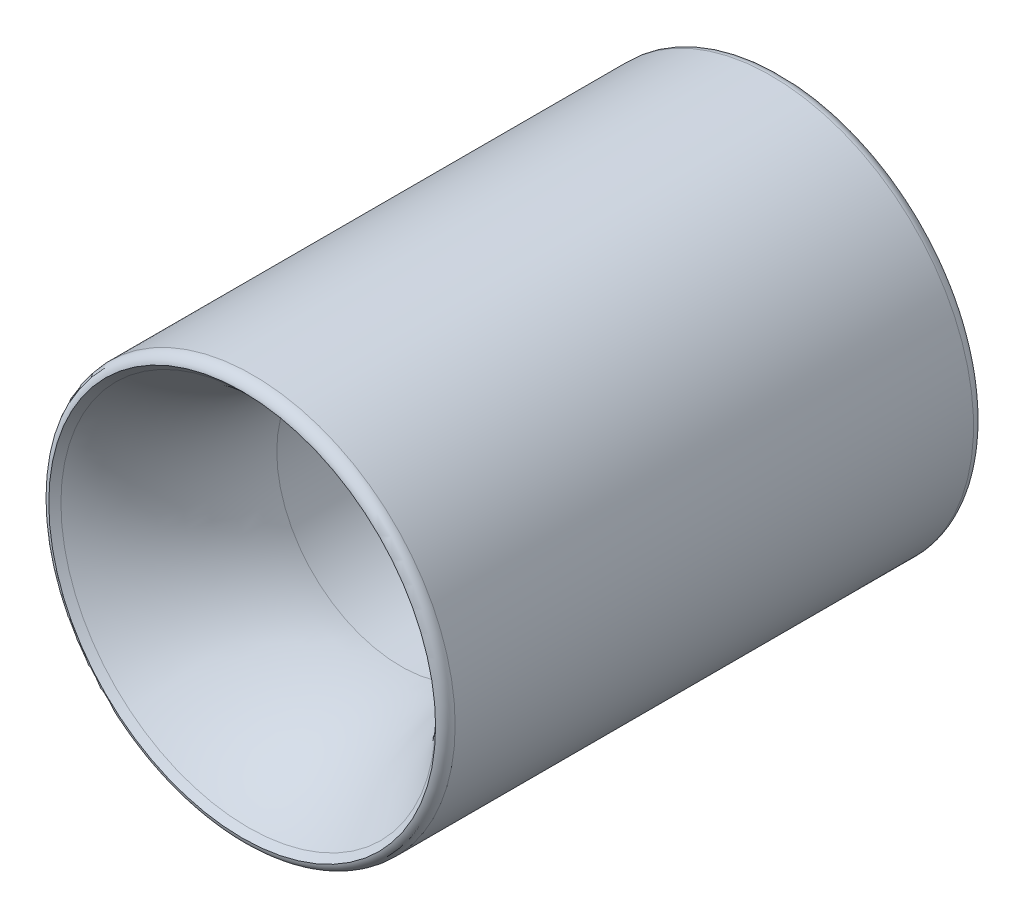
ISO-10303-21;
HEADER;
FILE_DESCRIPTION(('STEP AP214'),'2;1');
FILE_NAME('part.step','',(''),(''),'','','');
FILE_SCHEMA(('AUTOMOTIVE_DESIGN { 1 0 10303 214 1 1 1 1 }'));
ENDSEC;
DATA;
#1=APPLICATION_CONTEXT('core data for automotive mechanical design processes');
#2=APPLICATION_PROTOCOL_DEFINITION('international standard','automotive_design',2000,#1);
#3=PRODUCT_CONTEXT('',#1,'mechanical');
#4=PRODUCT('Part','Part','',(#3));
#5=PRODUCT_RELATED_PRODUCT_CATEGORY('part','',(#4));
#6=PRODUCT_DEFINITION_FORMATION('','',#4);
#7=PRODUCT_DEFINITION_CONTEXT('part definition',#1,'design');
#8=PRODUCT_DEFINITION('design','',#6,#7);
#9=PRODUCT_DEFINITION_SHAPE('','',#8);
#10=(LENGTH_UNIT() NAMED_UNIT(*) SI_UNIT(.MILLI.,.METRE.));
#11=(NAMED_UNIT(*) PLANE_ANGLE_UNIT() SI_UNIT($,.RADIAN.));
#12=(NAMED_UNIT(*) SI_UNIT($,.STERADIAN.) SOLID_ANGLE_UNIT());
#13=UNCERTAINTY_MEASURE_WITH_UNIT(LENGTH_MEASURE(1.E-05),#10,'distance_accuracy_value','');
#14=(GEOMETRIC_REPRESENTATION_CONTEXT(3) GLOBAL_UNCERTAINTY_ASSIGNED_CONTEXT((#13)) GLOBAL_UNIT_ASSIGNED_CONTEXT((#10,
#11,#12)) REPRESENTATION_CONTEXT('',''));
#15=CARTESIAN_POINT('',(0.,0.,0.));
#16=DIRECTION('',(0.,0.,1.));
#17=DIRECTION('',(1.,0.,0.));
#18=AXIS2_PLACEMENT_3D('',#15,#16,#17);
#19=CARTESIAN_POINT('',(0.,0.,6.35));
#20=DIRECTION('',(0.,0.,-1.));
#21=DIRECTION('',(-1.,0.,0.));
#22=AXIS2_PLACEMENT_3D('',#19,#20,#21);
#23=CYLINDRICAL_SURFACE('',#22,2.38125);
#24=CARTESIAN_POINT('',(0.,0.,0.125151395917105));
#25=DIRECTION('',(0.,0.,-1.));
#26=DIRECTION('',(-1.,0.,0.));
#27=AXIS2_PLACEMENT_3D('',#24,#25,#26);
#28=CIRCLE('',#27,2.38125);
#29=CARTESIAN_POINT('',(-2.38125,0.,0.125151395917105));
#30=VERTEX_POINT('',#29);
#31=EDGE_CURVE('E52',#30,#30,#28,.F.);
#32=ORIENTED_EDGE('',*,*,#31,.T.);
#33=EDGE_LOOP('',(#32));
#34=FACE_BOUND('',#33,.T.);
#35=CARTESIAN_POINT('',(0.,0.,6.22484860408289));
#36=DIRECTION('',(0.,0.,1.));
#37=DIRECTION('',(1.,0.,0.));
#38=AXIS2_PLACEMENT_3D('',#35,#36,#37);
#39=CIRCLE('',#38,2.38125);
#40=CARTESIAN_POINT('',(2.38125,0.,6.22484860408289));
#41=VERTEX_POINT('',#40);
#42=EDGE_CURVE('E55',#41,#41,#39,.F.);
#43=ORIENTED_EDGE('',*,*,#42,.T.);
#44=EDGE_LOOP('',(#43));
#45=FACE_BOUND('',#44,.T.);
#46=ADVANCED_FACE('F32',(#34,#45),#23,.T.);
#47=CARTESIAN_POINT('',(0.,0.,6.35));
#48=DIRECTION('',(0.,0.,-1.));
#49=DIRECTION('',(-1.,0.,0.));
#50=AXIS2_PLACEMENT_3D('',#47,#48,#49);
#51=CYLINDRICAL_SURFACE('',#50,1.4605);
#52=CARTESIAN_POINT('',(0.,0.,1.86744244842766));
#53=DIRECTION('',(0.,0.,1.));
#54=DIRECTION('',(1.,0.,0.));
#55=AXIS2_PLACEMENT_3D('',#52,#53,#54);
#56=CIRCLE('',#55,1.4605);
#57=CARTESIAN_POINT('',(1.4605,0.,1.86744244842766));
#58=VERTEX_POINT('',#57);
#59=EDGE_CURVE('E43',#58,#58,#56,.F.);
#60=ORIENTED_EDGE('',*,*,#59,.T.);
#61=EDGE_LOOP('',(#60));
#62=FACE_BOUND('',#61,.T.);
#63=CARTESIAN_POINT('',(0.,0.,4.48255755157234));
#64=DIRECTION('',(0.,0.,-1.));
#65=DIRECTION('',(-1.,0.,0.));
#66=AXIS2_PLACEMENT_3D('',#63,#64,#65);
#67=CIRCLE('',#66,1.4605);
#68=CARTESIAN_POINT('',(-1.4605,0.,4.48255755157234));
#69=VERTEX_POINT('',#68);
#70=EDGE_CURVE('E47',#69,#69,#67,.F.);
#71=ORIENTED_EDGE('',*,*,#70,.T.);
#72=EDGE_LOOP('',(#71));
#73=FACE_BOUND('',#72,.T.);
#74=ADVANCED_FACE('F70',(#62,#73),#51,.F.);
#75=CARTESIAN_POINT('',(0.,0.,5.53466));
#76=DIRECTION('',(0.,0.,1.));
#77=DIRECTION('',(1.,0.,0.));
#78=AXIS2_PLACEMENT_3D('',#75,#76,#77);
#79=CONICAL_SURFACE('',#78,1.4605,0.785398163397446);
#80=CARTESIAN_POINT('',(0.,0.,6.27860877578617));
#81=DIRECTION('',(0.,0.,-1.));
#82=DIRECTION('',(-1.,0.,0.));
#83=AXIS2_PLACEMENT_3D('',#80,#81,#82);
#84=CIRCLE('',#83,2.20444877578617);
#85=CARTESIAN_POINT('',(-2.20444877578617,0.,6.27860877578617));
#86=VERTEX_POINT('',#85);
#87=EDGE_CURVE('E10',#86,#86,#84,.T.);
#88=ORIENTED_EDGE('',*,*,#87,.T.);
#89=EDGE_LOOP('',(#88));
#90=FACE_BOUND('',#89,.T.);
#91=CARTESIAN_POINT('',(0.,0.,6.35));
#92=DIRECTION('',(0.,0.,1.));
#93=DIRECTION('',(1.,0.,0.));
#94=AXIS2_PLACEMENT_3D('',#91,#92,#93);
#95=CIRCLE('',#94,2.27584);
#96=CARTESIAN_POINT('',(2.27584,0.,6.35));
#97=VERTEX_POINT('',#96);
#98=EDGE_CURVE('E61',#97,#97,#95,.F.);
#99=ORIENTED_EDGE('',*,*,#98,.F.);
#100=EDGE_LOOP('',(#99));
#101=FACE_BOUND('',#100,.T.);
#102=ADVANCED_FACE('F67',(#90,#101),#79,.F.);
#103=CARTESIAN_POINT('',(0.,0.,0.));
#104=DIRECTION('',(0.,0.,-1.));
#105=DIRECTION('',(-1.,0.,0.));
#106=AXIS2_PLACEMENT_3D('',#103,#104,#105);
#107=CONICAL_SURFACE('',#106,2.27584,0.785398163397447);
#108=CARTESIAN_POINT('',(0.,0.,0.0713912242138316));
#109=DIRECTION('',(0.,0.,1.));
#110=DIRECTION('',(1.,0.,0.));
#111=AXIS2_PLACEMENT_3D('',#108,#109,#110);
#112=CIRCLE('',#111,2.20444877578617);
#113=CARTESIAN_POINT('',(2.20444877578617,0.,0.0713912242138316));
#114=VERTEX_POINT('',#113);
#115=EDGE_CURVE('E39',#114,#114,#112,.T.);
#116=ORIENTED_EDGE('',*,*,#115,.T.);
#117=EDGE_LOOP('',(#116));
#118=FACE_BOUND('',#117,.T.);
#119=CARTESIAN_POINT('',(0.,0.,0.));
#120=DIRECTION('',(0.,0.,1.));
#121=DIRECTION('',(1.,0.,0.));
#122=AXIS2_PLACEMENT_3D('',#119,#120,#121);
#123=CIRCLE('',#122,2.27584);
#124=CARTESIAN_POINT('',(2.27584,0.,0.));
#125=VERTEX_POINT('',#124);
#126=EDGE_CURVE('E58',#125,#125,#123,.T.);
#127=ORIENTED_EDGE('',*,*,#126,.F.);
#128=EDGE_LOOP('',(#127));
#129=FACE_BOUND('',#128,.T.);
#130=ADVANCED_FACE('F69',(#118,#129),#107,.F.);
#131=CARTESIAN_POINT('',(0.,0.,6.22484860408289));
#132=DIRECTION('',(0.,0.,1.));
#133=DIRECTION('',(1.,0.,0.));
#134=AXIS2_PLACEMENT_3D('',#131,#132,#133);
#135=TOROIDAL_SURFACE('',#134,2.25425,0.127);
#136=ORIENTED_EDGE('',*,*,#42,.F.);
#137=EDGE_LOOP('',(#136));
#138=FACE_BOUND('',#137,.T.);
#139=ORIENTED_EDGE('',*,*,#98,.T.);
#140=EDGE_LOOP('',(#139));
#141=FACE_BOUND('',#140,.T.);
#142=ADVANCED_FACE('F65',(#138,#141),#135,.T.);
#143=CARTESIAN_POINT('',(0.,0.,0.125151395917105));
#144=DIRECTION('',(0.,0.,-1.));
#145=DIRECTION('',(-1.,0.,0.));
#146=AXIS2_PLACEMENT_3D('',#143,#144,#145);
#147=TOROIDAL_SURFACE('',#146,2.25425,0.127);
#148=ORIENTED_EDGE('',*,*,#126,.T.);
#149=EDGE_LOOP('',(#148));
#150=FACE_BOUND('',#149,.T.);
#151=ORIENTED_EDGE('',*,*,#31,.F.);
#152=EDGE_LOOP('',(#151));
#153=FACE_BOUND('',#152,.T.);
#154=ADVANCED_FACE('F89',(#150,#153),#147,.T.);
#155=CARTESIAN_POINT('',(0.,0.,1.86744244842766));
#156=DIRECTION('',(0.,0.,1.));
#157=DIRECTION('',(1.,0.,0.));
#158=AXIS2_PLACEMENT_3D('',#155,#156,#157);
#159=TOROIDAL_SURFACE('',#158,4.0005,2.54);
#160=ORIENTED_EDGE('',*,*,#115,.F.);
#161=EDGE_LOOP('',(#160));
#162=FACE_BOUND('',#161,.T.);
#163=ORIENTED_EDGE('',*,*,#59,.F.);
#164=EDGE_LOOP('',(#163));
#165=FACE_BOUND('',#164,.T.);
#166=ADVANCED_FACE('F94',(#162,#165),#159,.T.);
#167=CARTESIAN_POINT('',(0.,0.,4.48255755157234));
#168=DIRECTION('',(0.,0.,-1.));
#169=DIRECTION('',(-1.,0.,0.));
#170=AXIS2_PLACEMENT_3D('',#167,#168,#169);
#171=TOROIDAL_SURFACE('',#170,4.0005,2.54);
#172=ORIENTED_EDGE('',*,*,#87,.F.);
#173=EDGE_LOOP('',(#172));
#174=FACE_BOUND('',#173,.T.);
#175=ORIENTED_EDGE('',*,*,#70,.F.);
#176=EDGE_LOOP('',(#175));
#177=FACE_BOUND('',#176,.T.);
#178=ADVANCED_FACE('F34',(#174,#177),#171,.T.);
#179=CLOSED_SHELL('',(#46,#74,#102,#130,#142,#154,#166,#178));
#180=MANIFOLD_SOLID_BREP('B2',#179);
#181=ADVANCED_BREP_SHAPE_REPRESENTATION('',(#18,#180),#14);
#182=SHAPE_DEFINITION_REPRESENTATION(#9,#181);
ENDSEC;
END-ISO-10303-21;
